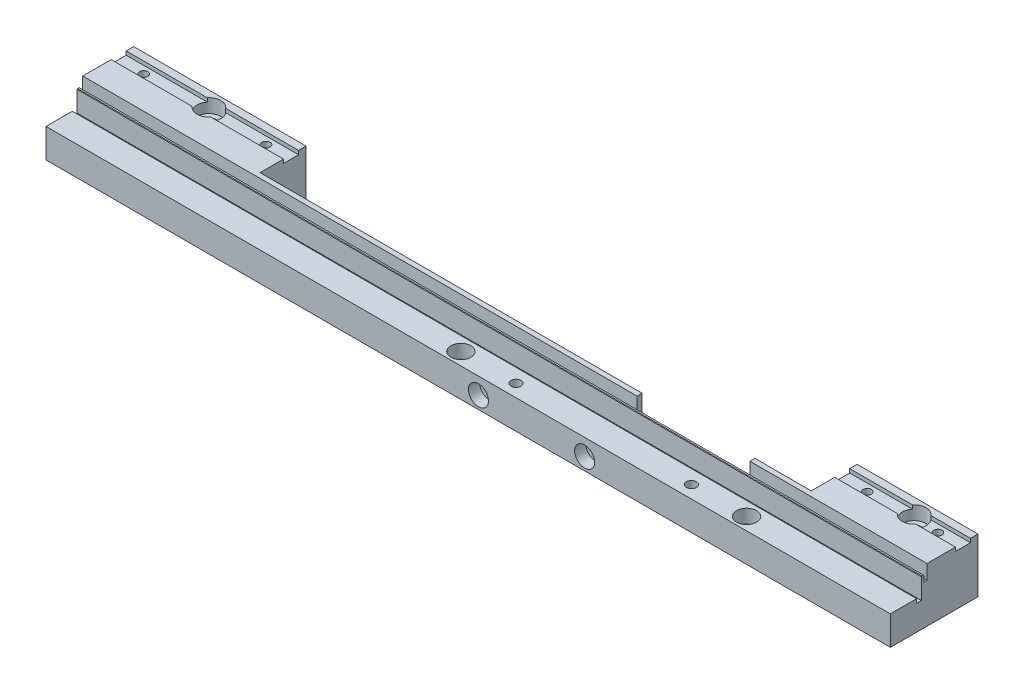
from build123d import *

# Parameters (mm, degrees)
EXTRUDE_1_DEPTH      = 35
SKETCH_3_OUTSIDE_W   = 104.902
SKETCH_3_OUTSIDE_H   = 91.602
CUT_EXTRUDE_1_DEPTH  = 340.50683351
SKETCH_4_OUTSIDE_W   = 406.902
SKETCH_4_OUTSIDE_H   = 104.902
SKETCH_4_OUTSIDE_R   = 2.75
SKETCH_4_OUTSIDE_R_2 = 2.25
SKETCH_4_OUTSIDE_R_3 = 1.65
SKETCH_4_OUTSIDE_R_4 = 2
CUT_EXTRUDE_2_DEPTH  = 35
SKETCH_5_R           = 4.75
CUT_EXTRUDE_3_DEPTH  = 5.5
SKETCH_6_R           = 4
CUT_EXTRUDE_4_DEPTH  = 5.5
SKETCH_7_R           = 2.25
CUT_EXTRUDE_5_DEPTH  = 340.50683351
SKETCH_8_R           = 4
CUT_EXTRUDE_6_DEPTH  = 4.5


with BuildPart() as part:
    # Sketch 2 → Extrude 1 (new body)
    with BuildSketch(Plane.XY):
        Polygon((0, 0), (0, 21.7), (221.3, 21.7), (221.3, 18.4), (266.3, 18.4), (266.3, 21.7), (337, 21.7), (337, 0), align=None)
    extrude(amount=EXTRUDE_1_DEPTH)

    # Sketch 3 outside → Cut-Extrude 1 (cut, through all)
    with BuildSketch(Plane(origin=(337, 0, 0), x_dir=(0, 0, -1), z_dir=(1, 0, 0))):
        with Locations((-17.5, 10.85)):
            Rectangle(SKETCH_3_OUTSIDE_W, SKETCH_3_OUTSIDE_H)
        Polygon((-35, 0), (-35, 11.6), (-24.5, 11.6), (-24.5, 10), (-22.6, 10), (-22.6, 18.2), (-22.4, 18.4), (-21.8, 18.4), (-21.6, 18.2), (-21.6, 15.9), (-20.36, 15.9), (-20.36, 21.7), (-9, 21.7), (-9, 20.2), (-3, 20.2), (-3, 21.7), (0, 21.7), (0, 0), align=None, mode=Mode.SUBTRACT)
    extrude(amount=-CUT_EXTRUDE_1_DEPTH, mode=Mode.SUBTRACT)

    # Sketch 4 outside → Cut-Extrude 2 (cut)
    # profile 1 of 11: a face of its own
    with BuildSketch(Plane(origin=(0, 21.7, 0), x_dir=(1, 0, 0), z_dir=(0, 1, 0))):
        with Locations((168.5, -17.5)):
            Rectangle(SKETCH_4_OUTSIDE_W, SKETCH_4_OUTSIDE_H)
        Polygon((0, 0), (68.8, 0), (68.8, -18.36), (221.3, -18.36), (221.3, -20.36), (266.3, -20.36), (266.3, -18.36), (288.8, -18.36), (288.8, 0), (337, 0), (337, -35), (0, -35), align=None, mode=Mode.SUBTRACT)
    # profile 2 of 11: a face of its own
    with BuildSketch(Plane(origin=(0, 21.7, 0), x_dir=(1, 0, 0), z_dir=(0, 1, 0))):
        with Locations(Location((36.05, -6, 0), (0, 0, 270))):
            Circle(SKETCH_4_OUTSIDE_R)
    # profile 3 of 11: a face of its own
    with BuildSketch(Plane(origin=(0, 21.7, 0), x_dir=(1, 0, 0), z_dir=(0, 1, 0))):
        with Locations(Location((160.6, -30, 0), (0, 0, 270))):
            Circle(SKETCH_4_OUTSIDE_R_2)
    # profile 4 of 11: a face of its own
    with BuildSketch(Plane(origin=(0, 21.7, 0), x_dir=(1, 0, 0), z_dir=(0, 1, 0))):
        with Locations(Location((274.6, -30, 0), (0, 0, 270))):
            Circle(SKETCH_4_OUTSIDE_R_2)
    # profile 5 of 11: a face of its own
    with BuildSketch(Plane(origin=(0, 21.7, 0), x_dir=(1, 0, 0), z_dir=(0, 1, 0))):
        with Locations(Location((317.5, -6, 0), (0, 0, 270))):
            Circle(SKETCH_4_OUTSIDE_R)
    # profile 6 of 11: a face of its own
    with BuildSketch(Plane(origin=(0, 21.7, 0), x_dir=(1, 0, 0), z_dir=(0, 1, 0))):
        with Locations(Location((58.8, -6, 0), (0, 0, 270))):
            Circle(SKETCH_4_OUTSIDE_R_3)
    # profile 7 of 11: a face of its own
    with BuildSketch(Plane(origin=(0, 21.7, 0), x_dir=(1, 0, 0), z_dir=(0, 1, 0))):
        with Locations(Location((10, -6, 0), (0, 0, 270))):
            Circle(SKETCH_4_OUTSIDE_R_3)
    # profile 8 of 11: a face of its own
    with BuildSketch(Plane(origin=(0, 21.7, 0), x_dir=(1, 0, 0), z_dir=(0, 1, 0))):
        with Locations(Location((298.8, -6, 0), (0, 0, 270))):
            Circle(SKETCH_4_OUTSIDE_R_3)
    # profile 9 of 11: a face of its own
    with BuildSketch(Plane(origin=(0, 21.7, 0), x_dir=(1, 0, 0), z_dir=(0, 1, 0))):
        with Locations(Location((327, -6, 0), (0, 0, 270))):
            Circle(SKETCH_4_OUTSIDE_R_3)
    # profile 10 of 11: a face of its own
    with BuildSketch(Plane(origin=(0, 21.7, 0), x_dir=(1, 0, 0), z_dir=(0, 1, 0))):
        with Locations(Location((182.6, -30, 0), (0, 0, 270))):
            Circle(SKETCH_4_OUTSIDE_R_4)
    # profile 11 of 11: a face of its own
    with BuildSketch(Plane(origin=(0, 21.7, 0), x_dir=(1, 0, 0), z_dir=(0, 1, 0))):
        with Locations(Location((252.6, -30, 0), (0, 0, 270))):
            Circle(SKETCH_4_OUTSIDE_R_4)
    extrude(amount=-CUT_EXTRUDE_2_DEPTH, mode=Mode.SUBTRACT)

    # Sketch 5 → Cut-Extrude 3 (cut)
    with BuildSketch(Plane(origin=(0, 21.7, 0), x_dir=(1, 0, 0), z_dir=(0, 1, 0))):
        with Locations(Location((36.05, -6, 0), (0, 0, 270))):
            Circle(SKETCH_5_R)
        with Locations(Location((317.5, -6, 0), (0, 0, 270))):
            Circle(SKETCH_5_R)
    extrude(amount=-CUT_EXTRUDE_3_DEPTH, mode=Mode.SUBTRACT)

    # Sketch 6 → Cut-Extrude 4 (cut)
    with BuildSketch(Plane(origin=(0, 11.6, 0), x_dir=(1, 0, 0), z_dir=(0, 1, 0))):
        with Locations(Location((160.6, -30, 0), (0, 0, 270))):
            Circle(SKETCH_6_R)
        with Locations(Location((274.6, -30, 0), (0, 0, 270))):
            Circle(SKETCH_6_R)
    extrude(amount=-CUT_EXTRUDE_4_DEPTH, mode=Mode.SUBTRACT)

    # Sketch 7 → Cut-Extrude 5 (cut, through all)
    with BuildSketch(Plane.XY.offset(35)):
        with Locations((215, 5)):
            Circle(SKETCH_7_R)
        with Locations((172.6, 5)):
            Circle(SKETCH_7_R)
    extrude(amount=-CUT_EXTRUDE_5_DEPTH, mode=Mode.SUBTRACT)

    # Sketch 8 → Cut-Extrude 6 (cut)
    with BuildSketch(Plane.XY.offset(35)):
        with Locations((215, 5)):
            Circle(SKETCH_8_R)
        with Locations((172.6, 5)):
            Circle(SKETCH_8_R)
    extrude(amount=-CUT_EXTRUDE_6_DEPTH, mode=Mode.SUBTRACT)


solid = part.part
